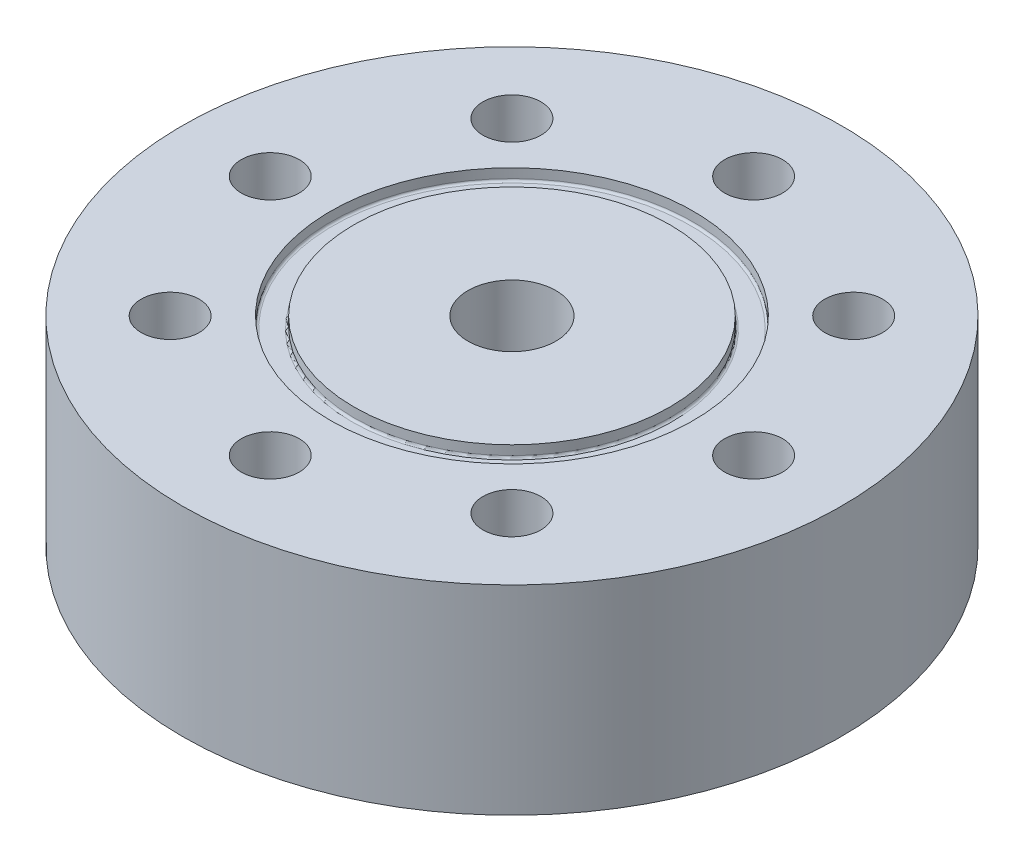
ISO-10303-21;
HEADER;
FILE_DESCRIPTION(('STEP AP214'),'2;1');
FILE_NAME('part.step','',(''),(''),'','','');
FILE_SCHEMA(('AUTOMOTIVE_DESIGN { 1 0 10303 214 1 1 1 1 }'));
ENDSEC;
DATA;
#1=APPLICATION_CONTEXT('core data for automotive mechanical design processes');
#2=APPLICATION_PROTOCOL_DEFINITION('international standard','automotive_design',2000,#1);
#3=PRODUCT_CONTEXT('',#1,'mechanical');
#4=PRODUCT('Part','Part','',(#3));
#5=PRODUCT_RELATED_PRODUCT_CATEGORY('part','',(#4));
#6=PRODUCT_DEFINITION_FORMATION('','',#4);
#7=PRODUCT_DEFINITION_CONTEXT('part definition',#1,'design');
#8=PRODUCT_DEFINITION('design','',#6,#7);
#9=PRODUCT_DEFINITION_SHAPE('','',#8);
#10=(LENGTH_UNIT() NAMED_UNIT(*) SI_UNIT(.MILLI.,.METRE.));
#11=(NAMED_UNIT(*) PLANE_ANGLE_UNIT() SI_UNIT($,.RADIAN.));
#12=(NAMED_UNIT(*) SI_UNIT($,.STERADIAN.) SOLID_ANGLE_UNIT());
#13=UNCERTAINTY_MEASURE_WITH_UNIT(LENGTH_MEASURE(1.E-05),#10,'distance_accuracy_value','');
#14=(GEOMETRIC_REPRESENTATION_CONTEXT(3) GLOBAL_UNCERTAINTY_ASSIGNED_CONTEXT((#13)) GLOBAL_UNIT_ASSIGNED_CONTEXT((#10,
#11,#12)) REPRESENTATION_CONTEXT('',''));
#15=CARTESIAN_POINT('',(0.,0.,0.));
#16=DIRECTION('',(0.,0.,1.));
#17=DIRECTION('',(1.,0.,0.));
#18=AXIS2_PLACEMENT_3D('',#15,#16,#17);
#19=CARTESIAN_POINT('',(0.,22.7,0.));
#20=DIRECTION('',(0.,-1.,0.));
#21=DIRECTION('',(0.,0.,-1.));
#22=AXIS2_PLACEMENT_3D('',#19,#20,#21);
#23=CYLINDRICAL_SURFACE('',#22,37.5);
#24=CARTESIAN_POINT('',(0.,22.7,0.));
#25=DIRECTION('',(0.,1.,0.));
#26=DIRECTION('',(0.,0.,1.));
#27=AXIS2_PLACEMENT_3D('',#24,#25,#26);
#28=CIRCLE('',#27,37.5);
#29=CARTESIAN_POINT('',(0.,22.7,37.5));
#30=VERTEX_POINT('',#29);
#31=EDGE_CURVE('E60',#30,#30,#28,.T.);
#32=ORIENTED_EDGE('',*,*,#31,.F.);
#33=EDGE_LOOP('',(#32));
#34=FACE_BOUND('',#33,.T.);
#35=CARTESIAN_POINT('',(0.,0.,0.));
#36=DIRECTION('',(0.,1.,0.));
#37=DIRECTION('',(0.,0.,1.));
#38=AXIS2_PLACEMENT_3D('',#35,#36,#37);
#39=CIRCLE('',#38,37.5);
#40=CARTESIAN_POINT('',(0.,0.,37.5));
#41=VERTEX_POINT('',#40);
#42=EDGE_CURVE('E61',#41,#41,#39,.T.);
#43=ORIENTED_EDGE('',*,*,#42,.T.);
#44=EDGE_LOOP('',(#43));
#45=FACE_BOUND('',#44,.T.);
#46=ADVANCED_FACE('F36',(#34,#45),#23,.T.);
#47=CARTESIAN_POINT('',(0.,22.7,0.));
#48=DIRECTION('',(0.,1.,0.));
#49=DIRECTION('',(0.,0.,1.));
#50=AXIS2_PLACEMENT_3D('',#47,#48,#49);
#51=PLANE('',#50);
#52=CARTESIAN_POINT('',(0.,22.7,0.));
#53=DIRECTION('',(0.,1.,0.));
#54=DIRECTION('',(0.,0.,1.));
#55=AXIS2_PLACEMENT_3D('',#52,#53,#54);
#56=CIRCLE('',#55,20.6375);
#57=CARTESIAN_POINT('',(0.,22.7,20.6375));
#58=VERTEX_POINT('',#57);
#59=EDGE_CURVE('E82',#58,#58,#56,.T.);
#60=ORIENTED_EDGE('',*,*,#59,.F.);
#61=EDGE_LOOP('',(#60));
#62=FACE_BOUND('',#61,.T.);
#63=CARTESIAN_POINT('',(-27.5,22.7,0.));
#64=DIRECTION('',(0.,-1.,0.));
#65=DIRECTION('',(0.,0.,-1.));
#66=AXIS2_PLACEMENT_3D('',#63,#64,#65);
#67=CIRCLE('',#66,3.3);
#68=CARTESIAN_POINT('',(-27.5,22.7,-3.3));
#69=VERTEX_POINT('',#68);
#70=EDGE_CURVE('E73',#69,#69,#67,.T.);
#71=ORIENTED_EDGE('',*,*,#70,.T.);
#72=EDGE_LOOP('',(#71));
#73=FACE_BOUND('',#72,.T.);
#74=CARTESIAN_POINT('',(-19.44543648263,22.7,19.4454364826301));
#75=DIRECTION('',(0.,-1.,0.));
#76=DIRECTION('',(0.,0.,-1.));
#77=AXIS2_PLACEMENT_3D('',#74,#75,#76);
#78=CIRCLE('',#77,3.30000000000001);
#79=CARTESIAN_POINT('',(-19.44543648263,22.7,16.1454364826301));
#80=VERTEX_POINT('',#79);
#81=EDGE_CURVE('E130',#80,#80,#78,.T.);
#82=ORIENTED_EDGE('',*,*,#81,.T.);
#83=EDGE_LOOP('',(#82));
#84=FACE_BOUND('',#83,.T.);
#85=CARTESIAN_POINT('',(0.,22.7,27.5));
#86=DIRECTION('',(0.,-1.,0.));
#87=DIRECTION('',(0.,0.,-1.));
#88=AXIS2_PLACEMENT_3D('',#85,#86,#87);
#89=CIRCLE('',#88,3.3);
#90=CARTESIAN_POINT('',(0.,22.7,24.2));
#91=VERTEX_POINT('',#90);
#92=EDGE_CURVE('E122',#91,#91,#89,.T.);
#93=ORIENTED_EDGE('',*,*,#92,.T.);
#94=EDGE_LOOP('',(#93));
#95=FACE_BOUND('',#94,.T.);
#96=CARTESIAN_POINT('',(19.4454364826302,22.7,19.44543648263));
#97=DIRECTION('',(0.,-1.,0.));
#98=DIRECTION('',(0.,0.,-1.));
#99=AXIS2_PLACEMENT_3D('',#96,#97,#98);
#100=CIRCLE('',#99,3.3);
#101=CARTESIAN_POINT('',(19.4454364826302,22.7,16.14543648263));
#102=VERTEX_POINT('',#101);
#103=EDGE_CURVE('E114',#102,#102,#100,.T.);
#104=ORIENTED_EDGE('',*,*,#103,.T.);
#105=EDGE_LOOP('',(#104));
#106=FACE_BOUND('',#105,.T.);
#107=CARTESIAN_POINT('',(27.5,22.7,-1.92031473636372E-13));
#108=DIRECTION('',(0.,-1.,0.));
#109=DIRECTION('',(0.,0.,-1.));
#110=AXIS2_PLACEMENT_3D('',#107,#108,#109);
#111=CIRCLE('',#110,3.3);
#112=CARTESIAN_POINT('',(27.5,22.7,-3.30000000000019));
#113=VERTEX_POINT('',#112);
#114=EDGE_CURVE('E106',#113,#113,#111,.T.);
#115=ORIENTED_EDGE('',*,*,#114,.T.);
#116=EDGE_LOOP('',(#115));
#117=FACE_BOUND('',#116,.T.);
#118=CARTESIAN_POINT('',(19.4454364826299,22.7,-19.4454364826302));
#119=DIRECTION('',(0.,-1.,0.));
#120=DIRECTION('',(0.,0.,-1.));
#121=AXIS2_PLACEMENT_3D('',#118,#119,#120);
#122=CIRCLE('',#121,3.3);
#123=CARTESIAN_POINT('',(19.4454364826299,22.7,-22.7454364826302));
#124=VERTEX_POINT('',#123);
#125=EDGE_CURVE('E98',#124,#124,#122,.T.);
#126=ORIENTED_EDGE('',*,*,#125,.T.);
#127=EDGE_LOOP('',(#126));
#128=FACE_BOUND('',#127,.T.);
#129=CARTESIAN_POINT('',(-2.88047210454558E-13,22.7,-27.5));
#130=DIRECTION('',(0.,-1.,0.));
#131=DIRECTION('',(0.,0.,-1.));
#132=AXIS2_PLACEMENT_3D('',#129,#130,#131);
#133=CIRCLE('',#132,3.3);
#134=CARTESIAN_POINT('',(-2.88047210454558E-13,22.7,-30.8));
#135=VERTEX_POINT('',#134);
#136=EDGE_CURVE('E90',#135,#135,#133,.T.);
#137=ORIENTED_EDGE('',*,*,#136,.T.);
#138=EDGE_LOOP('',(#137));
#139=FACE_BOUND('',#138,.T.);
#140=CARTESIAN_POINT('',(-19.4454364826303,22.7,-19.4454364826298));
#141=DIRECTION('',(0.,-1.,0.));
#142=DIRECTION('',(0.,0.,-1.));
#143=AXIS2_PLACEMENT_3D('',#140,#141,#142);
#144=CIRCLE('',#143,3.3);
#145=CARTESIAN_POINT('',(-19.4454364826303,22.7,-22.7454364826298));
#146=VERTEX_POINT('',#145);
#147=EDGE_CURVE('E81',#146,#146,#144,.T.);
#148=ORIENTED_EDGE('',*,*,#147,.T.);
#149=EDGE_LOOP('',(#148));
#150=FACE_BOUND('',#149,.T.);
#151=ORIENTED_EDGE('',*,*,#31,.T.);
#152=EDGE_LOOP('',(#151));
#153=FACE_BOUND('',#152,.T.);
#154=ADVANCED_FACE('F172',(#62,#73,#84,#95,#106,#117,#128,#139,#150,#153),#51,.T.);
#155=CARTESIAN_POINT('',(0.,0.,0.));
#156=DIRECTION('',(0.,1.,0.));
#157=DIRECTION('',(0.,0.,1.));
#158=AXIS2_PLACEMENT_3D('',#155,#156,#157);
#159=PLANE('',#158);
#160=CARTESIAN_POINT('',(-27.5,0.,0.));
#161=DIRECTION('',(0.,-1.,0.));
#162=DIRECTION('',(0.,0.,-1.));
#163=AXIS2_PLACEMENT_3D('',#160,#161,#162);
#164=CIRCLE('',#163,3.3);
#165=CARTESIAN_POINT('',(-27.5,0.,-3.3));
#166=VERTEX_POINT('',#165);
#167=EDGE_CURVE('E134',#166,#166,#164,.T.);
#168=ORIENTED_EDGE('',*,*,#167,.F.);
#169=EDGE_LOOP('',(#168));
#170=FACE_BOUND('',#169,.T.);
#171=CARTESIAN_POINT('',(-19.44543648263,0.,19.4454364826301));
#172=DIRECTION('',(0.,-1.,0.));
#173=DIRECTION('',(0.,0.,-1.));
#174=AXIS2_PLACEMENT_3D('',#171,#172,#173);
#175=CIRCLE('',#174,3.30000000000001);
#176=CARTESIAN_POINT('',(-19.44543648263,0.,16.1454364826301));
#177=VERTEX_POINT('',#176);
#178=EDGE_CURVE('E126',#177,#177,#175,.T.);
#179=ORIENTED_EDGE('',*,*,#178,.F.);
#180=EDGE_LOOP('',(#179));
#181=FACE_BOUND('',#180,.T.);
#182=CARTESIAN_POINT('',(0.,0.,27.5));
#183=DIRECTION('',(0.,-1.,0.));
#184=DIRECTION('',(0.,0.,-1.));
#185=AXIS2_PLACEMENT_3D('',#182,#183,#184);
#186=CIRCLE('',#185,3.3);
#187=CARTESIAN_POINT('',(0.,0.,24.2));
#188=VERTEX_POINT('',#187);
#189=EDGE_CURVE('E118',#188,#188,#186,.T.);
#190=ORIENTED_EDGE('',*,*,#189,.F.);
#191=EDGE_LOOP('',(#190));
#192=FACE_BOUND('',#191,.T.);
#193=CARTESIAN_POINT('',(19.4454364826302,0.,19.44543648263));
#194=DIRECTION('',(0.,-1.,0.));
#195=DIRECTION('',(0.,0.,-1.));
#196=AXIS2_PLACEMENT_3D('',#193,#194,#195);
#197=CIRCLE('',#196,3.3);
#198=CARTESIAN_POINT('',(19.4454364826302,0.,16.14543648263));
#199=VERTEX_POINT('',#198);
#200=EDGE_CURVE('E110',#199,#199,#197,.T.);
#201=ORIENTED_EDGE('',*,*,#200,.F.);
#202=EDGE_LOOP('',(#201));
#203=FACE_BOUND('',#202,.T.);
#204=CARTESIAN_POINT('',(27.5,0.,-1.92031473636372E-13));
#205=DIRECTION('',(0.,-1.,0.));
#206=DIRECTION('',(0.,0.,-1.));
#207=AXIS2_PLACEMENT_3D('',#204,#205,#206);
#208=CIRCLE('',#207,3.3);
#209=CARTESIAN_POINT('',(27.5,0.,-3.30000000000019));
#210=VERTEX_POINT('',#209);
#211=EDGE_CURVE('E102',#210,#210,#208,.T.);
#212=ORIENTED_EDGE('',*,*,#211,.F.);
#213=EDGE_LOOP('',(#212));
#214=FACE_BOUND('',#213,.T.);
#215=CARTESIAN_POINT('',(19.4454364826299,0.,-19.4454364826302));
#216=DIRECTION('',(0.,-1.,0.));
#217=DIRECTION('',(0.,0.,-1.));
#218=AXIS2_PLACEMENT_3D('',#215,#216,#217);
#219=CIRCLE('',#218,3.3);
#220=CARTESIAN_POINT('',(19.4454364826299,0.,-22.7454364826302));
#221=VERTEX_POINT('',#220);
#222=EDGE_CURVE('E94',#221,#221,#219,.T.);
#223=ORIENTED_EDGE('',*,*,#222,.F.);
#224=EDGE_LOOP('',(#223));
#225=FACE_BOUND('',#224,.T.);
#226=CARTESIAN_POINT('',(-2.88047210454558E-13,0.,-27.5));
#227=DIRECTION('',(0.,-1.,0.));
#228=DIRECTION('',(0.,0.,-1.));
#229=AXIS2_PLACEMENT_3D('',#226,#227,#228);
#230=CIRCLE('',#229,3.3);
#231=CARTESIAN_POINT('',(-2.88047210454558E-13,0.,-30.8));
#232=VERTEX_POINT('',#231);
#233=EDGE_CURVE('E86',#232,#232,#230,.T.);
#234=ORIENTED_EDGE('',*,*,#233,.F.);
#235=EDGE_LOOP('',(#234));
#236=FACE_BOUND('',#235,.T.);
#237=CARTESIAN_POINT('',(-19.4454364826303,0.,-19.4454364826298));
#238=DIRECTION('',(0.,-1.,0.));
#239=DIRECTION('',(0.,0.,-1.));
#240=AXIS2_PLACEMENT_3D('',#237,#238,#239);
#241=CIRCLE('',#240,3.3);
#242=CARTESIAN_POINT('',(-19.4454364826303,0.,-22.7454364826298));
#243=VERTEX_POINT('',#242);
#244=EDGE_CURVE('E77',#243,#243,#241,.T.);
#245=ORIENTED_EDGE('',*,*,#244,.F.);
#246=EDGE_LOOP('',(#245));
#247=FACE_BOUND('',#246,.T.);
#248=CARTESIAN_POINT('',(0.,0.,0.));
#249=DIRECTION('',(0.,-1.,0.));
#250=DIRECTION('',(0.,0.,-1.));
#251=AXIS2_PLACEMENT_3D('',#248,#249,#250);
#252=CIRCLE('',#251,8.93);
#253=CARTESIAN_POINT('',(0.,0.,-8.93));
#254=VERTEX_POINT('',#253);
#255=EDGE_CURVE('E69',#254,#254,#252,.T.);
#256=ORIENTED_EDGE('',*,*,#255,.F.);
#257=EDGE_LOOP('',(#256));
#258=FACE_BOUND('',#257,.T.);
#259=ORIENTED_EDGE('',*,*,#42,.F.);
#260=EDGE_LOOP('',(#259));
#261=FACE_BOUND('',#260,.T.);
#262=ADVANCED_FACE('F192',(#170,#181,#192,#203,#214,#225,#236,#247,#258,#261),#159,.F.);
#263=CARTESIAN_POINT('',(0.,12.7,0.));
#264=DIRECTION('',(0.,-1.,0.));
#265=DIRECTION('',(0.,0.,-1.));
#266=AXIS2_PLACEMENT_3D('',#263,#264,#265);
#267=CYLINDRICAL_SURFACE('',#266,8.93);
#268=CARTESIAN_POINT('',(0.,12.7,0.));
#269=DIRECTION('',(0.,-1.,0.));
#270=DIRECTION('',(0.,0.,-1.));
#271=AXIS2_PLACEMENT_3D('',#268,#269,#270);
#272=CIRCLE('',#271,8.93);
#273=CARTESIAN_POINT('',(0.,12.7,-8.93));
#274=VERTEX_POINT('',#273);
#275=EDGE_CURVE('E65',#274,#274,#272,.T.);
#276=ORIENTED_EDGE('',*,*,#275,.F.);
#277=EDGE_LOOP('',(#276));
#278=FACE_BOUND('',#277,.T.);
#279=ORIENTED_EDGE('',*,*,#255,.T.);
#280=EDGE_LOOP('',(#279));
#281=FACE_BOUND('',#280,.T.);
#282=ADVANCED_FACE('F228',(#278,#281),#267,.F.);
#283=CARTESIAN_POINT('',(0.,12.7,0.));
#284=DIRECTION('',(0.,-1.,0.));
#285=DIRECTION('',(0.,0.,-1.));
#286=AXIS2_PLACEMENT_3D('',#283,#284,#285);
#287=PLANE('',#286);
#288=CARTESIAN_POINT('',(0.,12.7,0.));
#289=DIRECTION('',(0.,1.,0.));
#290=DIRECTION('',(0.,0.,1.));
#291=AXIS2_PLACEMENT_3D('',#288,#289,#290);
#292=CIRCLE('',#291,5.);
#293=CARTESIAN_POINT('',(0.,12.7,5.));
#294=VERTEX_POINT('',#293);
#295=EDGE_CURVE('E148',#294,#294,#292,.T.);
#296=ORIENTED_EDGE('',*,*,#295,.T.);
#297=EDGE_LOOP('',(#296));
#298=FACE_BOUND('',#297,.T.);
#299=ORIENTED_EDGE('',*,*,#275,.T.);
#300=EDGE_LOOP('',(#299));
#301=FACE_BOUND('',#300,.T.);
#302=ADVANCED_FACE('F157',(#298,#301),#287,.T.);
#303=CARTESIAN_POINT('',(-19.4454364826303,22.7,-19.4454364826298));
#304=DIRECTION('',(0.,-1.,0.));
#305=DIRECTION('',(0.,0.,-1.));
#306=AXIS2_PLACEMENT_3D('',#303,#304,#305);
#307=CYLINDRICAL_SURFACE('',#306,3.3);
#308=ORIENTED_EDGE('',*,*,#147,.F.);
#309=EDGE_LOOP('',(#308));
#310=FACE_BOUND('',#309,.T.);
#311=ORIENTED_EDGE('',*,*,#244,.T.);
#312=EDGE_LOOP('',(#311));
#313=FACE_BOUND('',#312,.T.);
#314=ADVANCED_FACE('F227',(#310,#313),#307,.F.);
#315=CARTESIAN_POINT('',(-2.88047210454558E-13,22.7,-27.5));
#316=DIRECTION('',(0.,-1.,0.));
#317=DIRECTION('',(0.,0.,-1.));
#318=AXIS2_PLACEMENT_3D('',#315,#316,#317);
#319=CYLINDRICAL_SURFACE('',#318,3.3);
#320=ORIENTED_EDGE('',*,*,#136,.F.);
#321=EDGE_LOOP('',(#320));
#322=FACE_BOUND('',#321,.T.);
#323=ORIENTED_EDGE('',*,*,#233,.T.);
#324=EDGE_LOOP('',(#323));
#325=FACE_BOUND('',#324,.T.);
#326=ADVANCED_FACE('F244',(#322,#325),#319,.F.);
#327=CARTESIAN_POINT('',(19.4454364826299,22.7,-19.4454364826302));
#328=DIRECTION('',(0.,-1.,0.));
#329=DIRECTION('',(0.,0.,-1.));
#330=AXIS2_PLACEMENT_3D('',#327,#328,#329);
#331=CYLINDRICAL_SURFACE('',#330,3.3);
#332=ORIENTED_EDGE('',*,*,#125,.F.);
#333=EDGE_LOOP('',(#332));
#334=FACE_BOUND('',#333,.T.);
#335=ORIENTED_EDGE('',*,*,#222,.T.);
#336=EDGE_LOOP('',(#335));
#337=FACE_BOUND('',#336,.T.);
#338=ADVANCED_FACE('F252',(#334,#337),#331,.F.);
#339=CARTESIAN_POINT('',(27.5,22.7,-1.92031473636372E-13));
#340=DIRECTION('',(0.,-1.,0.));
#341=DIRECTION('',(0.,0.,-1.));
#342=AXIS2_PLACEMENT_3D('',#339,#340,#341);
#343=CYLINDRICAL_SURFACE('',#342,3.3);
#344=ORIENTED_EDGE('',*,*,#114,.F.);
#345=EDGE_LOOP('',(#344));
#346=FACE_BOUND('',#345,.T.);
#347=ORIENTED_EDGE('',*,*,#211,.T.);
#348=EDGE_LOOP('',(#347));
#349=FACE_BOUND('',#348,.T.);
#350=ADVANCED_FACE('F260',(#346,#349),#343,.F.);
#351=CARTESIAN_POINT('',(19.4454364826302,22.7,19.44543648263));
#352=DIRECTION('',(0.,-1.,0.));
#353=DIRECTION('',(0.,0.,-1.));
#354=AXIS2_PLACEMENT_3D('',#351,#352,#353);
#355=CYLINDRICAL_SURFACE('',#354,3.3);
#356=ORIENTED_EDGE('',*,*,#103,.F.);
#357=EDGE_LOOP('',(#356));
#358=FACE_BOUND('',#357,.T.);
#359=ORIENTED_EDGE('',*,*,#200,.T.);
#360=EDGE_LOOP('',(#359));
#361=FACE_BOUND('',#360,.T.);
#362=ADVANCED_FACE('F268',(#358,#361),#355,.F.);
#363=CARTESIAN_POINT('',(0.,22.7,27.5));
#364=DIRECTION('',(0.,-1.,0.));
#365=DIRECTION('',(0.,0.,-1.));
#366=AXIS2_PLACEMENT_3D('',#363,#364,#365);
#367=CYLINDRICAL_SURFACE('',#366,3.3);
#368=ORIENTED_EDGE('',*,*,#92,.F.);
#369=EDGE_LOOP('',(#368));
#370=FACE_BOUND('',#369,.T.);
#371=ORIENTED_EDGE('',*,*,#189,.T.);
#372=EDGE_LOOP('',(#371));
#373=FACE_BOUND('',#372,.T.);
#374=ADVANCED_FACE('F276',(#370,#373),#367,.F.);
#375=CARTESIAN_POINT('',(-19.44543648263,22.7,19.4454364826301));
#376=DIRECTION('',(0.,-1.,0.));
#377=DIRECTION('',(0.,0.,-1.));
#378=AXIS2_PLACEMENT_3D('',#375,#376,#377);
#379=CYLINDRICAL_SURFACE('',#378,3.30000000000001);
#380=ORIENTED_EDGE('',*,*,#81,.F.);
#381=EDGE_LOOP('',(#380));
#382=FACE_BOUND('',#381,.T.);
#383=ORIENTED_EDGE('',*,*,#178,.T.);
#384=EDGE_LOOP('',(#383));
#385=FACE_BOUND('',#384,.T.);
#386=ADVANCED_FACE('F284',(#382,#385),#379,.F.);
#387=CARTESIAN_POINT('',(-27.5,22.7,0.));
#388=DIRECTION('',(0.,-1.,0.));
#389=DIRECTION('',(0.,0.,-1.));
#390=AXIS2_PLACEMENT_3D('',#387,#388,#389);
#391=CYLINDRICAL_SURFACE('',#390,3.3);
#392=ORIENTED_EDGE('',*,*,#70,.F.);
#393=EDGE_LOOP('',(#392));
#394=FACE_BOUND('',#393,.T.);
#395=ORIENTED_EDGE('',*,*,#167,.T.);
#396=EDGE_LOOP('',(#395));
#397=FACE_BOUND('',#396,.T.);
#398=ADVANCED_FACE('F292',(#394,#397),#391,.F.);
#399=CARTESIAN_POINT('',(0.,21.3792,0.));
#400=DIRECTION('',(0.,1.,0.));
#401=DIRECTION('',(0.,0.,1.));
#402=AXIS2_PLACEMENT_3D('',#399,#400,#401);
#403=CYLINDRICAL_SURFACE('',#402,20.6375);
#404=CARTESIAN_POINT('',(0.,21.6332,0.));
#405=DIRECTION('',(0.,1.,0.));
#406=DIRECTION('',(0.,0.,1.));
#407=AXIS2_PLACEMENT_3D('',#404,#405,#406);
#408=CIRCLE('',#407,20.6375);
#409=CARTESIAN_POINT('',(0.,21.6332,20.6375));
#410=VERTEX_POINT('',#409);
#411=EDGE_CURVE('E10',#410,#410,#408,.F.);
#412=ORIENTED_EDGE('',*,*,#411,.T.);
#413=EDGE_LOOP('',(#412));
#414=FACE_BOUND('',#413,.T.);
#415=ORIENTED_EDGE('',*,*,#59,.T.);
#416=EDGE_LOOP('',(#415));
#417=FACE_BOUND('',#416,.T.);
#418=ADVANCED_FACE('F183',(#414,#417),#403,.F.);
#419=CARTESIAN_POINT('',(0.,21.3792,0.));
#420=DIRECTION('',(0.,1.,0.));
#421=DIRECTION('',(0.,0.,1.));
#422=AXIS2_PLACEMENT_3D('',#419,#420,#421);
#423=PLANE('',#422);
#424=CARTESIAN_POINT('',(0.,21.3792,0.));
#425=DIRECTION('',(0.,1.,0.));
#426=DIRECTION('',(0.,0.,1.));
#427=AXIS2_PLACEMENT_3D('',#424,#425,#426);
#428=CIRCLE('',#427,18.2245);
#429=CARTESIAN_POINT('',(0.,21.3792,18.2245));
#430=VERTEX_POINT('',#429);
#431=EDGE_CURVE('E44',#430,#430,#428,.F.);
#432=ORIENTED_EDGE('',*,*,#431,.T.);
#433=EDGE_LOOP('',(#432));
#434=FACE_BOUND('',#433,.T.);
#435=CARTESIAN_POINT('',(0.,21.3792,0.));
#436=DIRECTION('',(0.,1.,0.));
#437=DIRECTION('',(0.,0.,1.));
#438=AXIS2_PLACEMENT_3D('',#435,#436,#437);
#439=CIRCLE('',#438,20.3835);
#440=CARTESIAN_POINT('',(0.,21.3792,20.3835));
#441=VERTEX_POINT('',#440);
#442=EDGE_CURVE('E49',#441,#441,#439,.T.);
#443=ORIENTED_EDGE('',*,*,#442,.T.);
#444=EDGE_LOOP('',(#443));
#445=FACE_BOUND('',#444,.T.);
#446=ADVANCED_FACE('F176',(#434,#445),#423,.T.);
#447=CARTESIAN_POINT('',(0.,21.3792,0.));
#448=DIRECTION('',(0.,1.,0.));
#449=DIRECTION('',(0.,0.,1.));
#450=AXIS2_PLACEMENT_3D('',#447,#448,#449);
#451=CYLINDRICAL_SURFACE('',#450,17.9705);
#452=CARTESIAN_POINT('',(0.,21.6332,0.));
#453=DIRECTION('',(0.,1.,0.));
#454=DIRECTION('',(0.,0.,1.));
#455=AXIS2_PLACEMENT_3D('',#452,#453,#454);
#456=CIRCLE('',#455,17.9705);
#457=CARTESIAN_POINT('',(0.,21.6332,17.9705));
#458=VERTEX_POINT('',#457);
#459=EDGE_CURVE('E54',#458,#458,#456,.T.);
#460=ORIENTED_EDGE('',*,*,#459,.T.);
#461=EDGE_LOOP('',(#460));
#462=FACE_BOUND('',#461,.T.);
#463=CARTESIAN_POINT('',(0.,22.7,0.));
#464=DIRECTION('',(0.,1.,0.));
#465=DIRECTION('',(0.,0.,1.));
#466=AXIS2_PLACEMENT_3D('',#463,#464,#465);
#467=CIRCLE('',#466,17.9705);
#468=CARTESIAN_POINT('',(0.,22.7,17.9705));
#469=VERTEX_POINT('',#468);
#470=EDGE_CURVE('E144',#469,#469,#467,.T.);
#471=ORIENTED_EDGE('',*,*,#470,.F.);
#472=EDGE_LOOP('',(#471));
#473=FACE_BOUND('',#472,.T.);
#474=ADVANCED_FACE('F170',(#462,#473),#451,.T.);
#475=CARTESIAN_POINT('',(0.,22.7,0.));
#476=DIRECTION('',(0.,1.,0.));
#477=DIRECTION('',(0.,0.,1.));
#478=AXIS2_PLACEMENT_3D('',#475,#476,#477);
#479=CIRCLE('',#478,5.);
#480=CARTESIAN_POINT('',(0.,22.7,5.));
#481=VERTEX_POINT('',#480);
#482=EDGE_CURVE('E149',#481,#481,#479,.T.);
#483=ORIENTED_EDGE('',*,*,#482,.F.);
#484=EDGE_LOOP('',(#483));
#485=FACE_BOUND('',#484,.T.);
#486=ORIENTED_EDGE('',*,*,#470,.T.);
#487=EDGE_LOOP('',(#486));
#488=FACE_BOUND('',#487,.T.);
#489=ADVANCED_FACE('F166',(#485,#488),#51,.T.);
#490=CARTESIAN_POINT('',(0.,21.6332,0.));
#491=DIRECTION('',(0.,1.,0.));
#492=DIRECTION('',(0.,0.,1.));
#493=AXIS2_PLACEMENT_3D('',#490,#491,#492);
#494=TOROIDAL_SURFACE('',#493,18.2245,0.254);
#495=ORIENTED_EDGE('',*,*,#431,.F.);
#496=EDGE_LOOP('',(#495));
#497=FACE_BOUND('',#496,.T.);
#498=ORIENTED_EDGE('',*,*,#459,.F.);
#499=EDGE_LOOP('',(#498));
#500=FACE_BOUND('',#499,.T.);
#501=ADVANCED_FACE('F169',(#497,#500),#494,.F.);
#502=CARTESIAN_POINT('',(0.,21.6332,0.));
#503=DIRECTION('',(0.,1.,0.));
#504=DIRECTION('',(0.,0.,1.));
#505=AXIS2_PLACEMENT_3D('',#502,#503,#504);
#506=TOROIDAL_SURFACE('',#505,20.3835,0.254);
#507=ORIENTED_EDGE('',*,*,#411,.F.);
#508=EDGE_LOOP('',(#507));
#509=FACE_BOUND('',#508,.T.);
#510=ORIENTED_EDGE('',*,*,#442,.F.);
#511=EDGE_LOOP('',(#510));
#512=FACE_BOUND('',#511,.T.);
#513=ADVANCED_FACE('F38',(#509,#512),#506,.F.);
#514=CARTESIAN_POINT('',(0.,12.7,0.));
#515=DIRECTION('',(0.,1.,0.));
#516=DIRECTION('',(0.,0.,1.));
#517=AXIS2_PLACEMENT_3D('',#514,#515,#516);
#518=CYLINDRICAL_SURFACE('',#517,5.);
#519=ORIENTED_EDGE('',*,*,#295,.F.);
#520=EDGE_LOOP('',(#519));
#521=FACE_BOUND('',#520,.T.);
#522=ORIENTED_EDGE('',*,*,#482,.T.);
#523=EDGE_LOOP('',(#522));
#524=FACE_BOUND('',#523,.T.);
#525=ADVANCED_FACE('F160',(#521,#524),#518,.F.);
#526=CLOSED_SHELL('',(#46,#154,#262,#282,#302,#314,#326,#338,#350,#362,#374,#386,#398,#418,#446,
#474,#489,#501,#513,#525));
#527=MANIFOLD_SOLID_BREP('B2',#526);
#528=ADVANCED_BREP_SHAPE_REPRESENTATION('',(#18,#527),#14);
#529=SHAPE_DEFINITION_REPRESENTATION(#9,#528);
ENDSEC;
END-ISO-10303-21;
